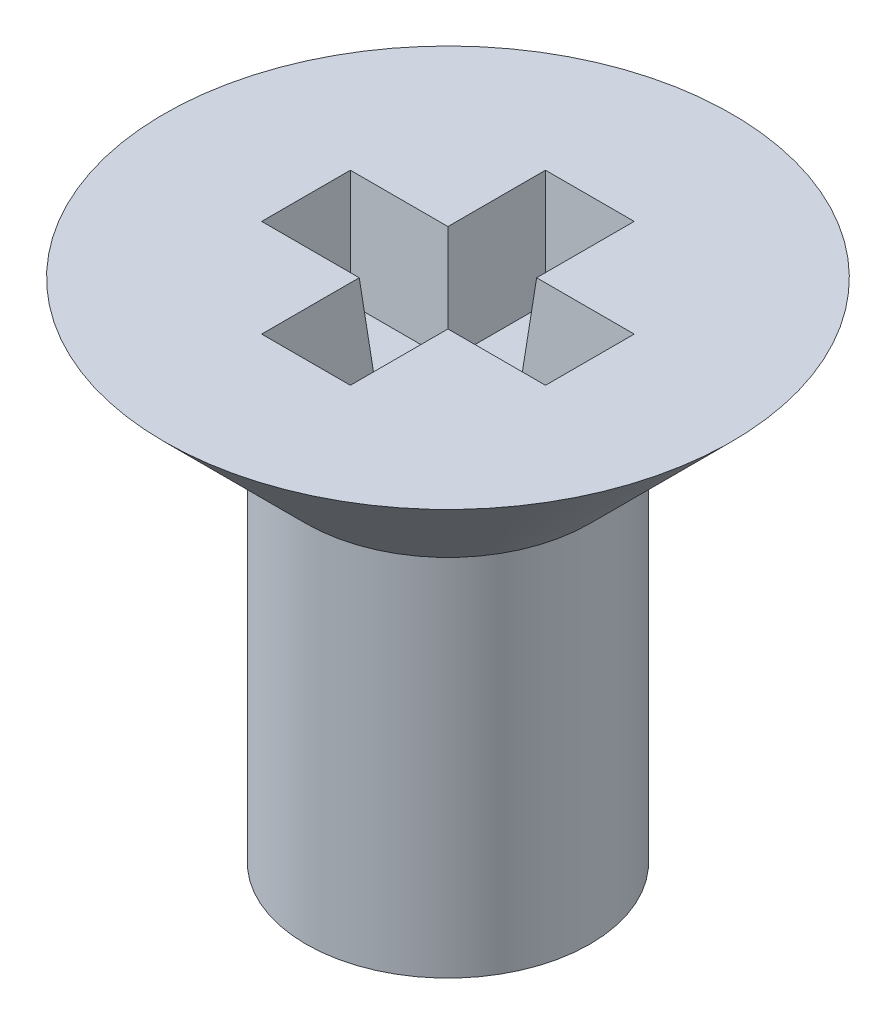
from build123d import *

# Parameters (mm, degrees)
CUT_EXTRUDE1_DEPTH = 1.5
CUT_EXTRUDE1_DRAFT = -5
CHAMFER1_SIZE      = 1.5
CHAMFER1_SIZE2     = 0.866025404


with BuildPart() as part:
    # Sketch1 → Revolve1 (revolve)
    with BuildSketch(Plane.XY, mode=Mode.PRIVATE) as revolve1_sk:
        Polygon((0, 0), (-2, 0), (-2, 6), (-4, 8), (0, 8), align=None)
    revolve(revolve1_sk.sketch.rotate(Axis((0, 0, 0), (0, -1, 0)), 270), axis=Axis((0, 0, 0), (0, -1, 0)))


with BuildPart() as cut_extrude1_tool:
    # Sketch2 → Cut-Extrude1 (with draft: the straight prism first)
    with BuildSketch(Plane(origin=(0, 8, 0), x_dir=(1, 0, 0), z_dir=(0, 1, 0))):
        Polygon((-0.625, 2), (-0.625, 0.625), (-2, 0.625), (-2, -0.625), (-0.625, -0.625), (-0.625, -2), (0.625, -2), (0.625, -0.625), (2, -0.625), (2, 0.625), (0.625, 0.625), (0.625, 2), align=None)
    extrude(amount=-CUT_EXTRUDE1_DEPTH)
    # Cut-Extrude1: the draft: its side faces are tilted about the plane it starts from
    cut_extrude1_sides = [cut_extrude1_tool.faces().sort_by_distance(p)[0] for p in [
        (-0.625, 7.25, -1.3125),
        (-1.3125, 7.25, -0.625),
        (-2, 7.25, 0),
        (-1.3125, 7.25, 0.625),
        (-0.625, 7.25, 1.3125),
        (0, 7.25, 2),
        (0.625, 7.25, 1.3125),
        (1.3125, 7.25, 0.625),
        (2, 7.25, 0),
        (1.3125, 7.25, -0.625),
        (0.625, 7.25, -1.3125),
        (0, 7.25, -2),
    ]]
    draft(cut_extrude1_sides, Plane(origin=(0, 8, 0), x_dir=(1, 0, 0), z_dir=(0, 1, 0)), CUT_EXTRUDE1_DRAFT)


with BuildPart() as part_1:
    add(part.part)

    # Cut-Extrude1: cut by cut_extrude1_tool
    add(cut_extrude1_tool.part, mode=Mode.SUBTRACT)

    # Chamfer1
    chamfer1_edges = [part_1.edges().sort_by_distance(p)[0] for p in [
        (0, 0, -2),
    ]]
    chamfer1_side = [part_1.faces().sort_by_distance(p)[0] for p in [
        (0, 0, 0),
    ]]
    chamfer(chamfer1_edges, length=CHAMFER1_SIZE, length2=CHAMFER1_SIZE2, reference=chamfer1_side[0])


solid = part_1.part
